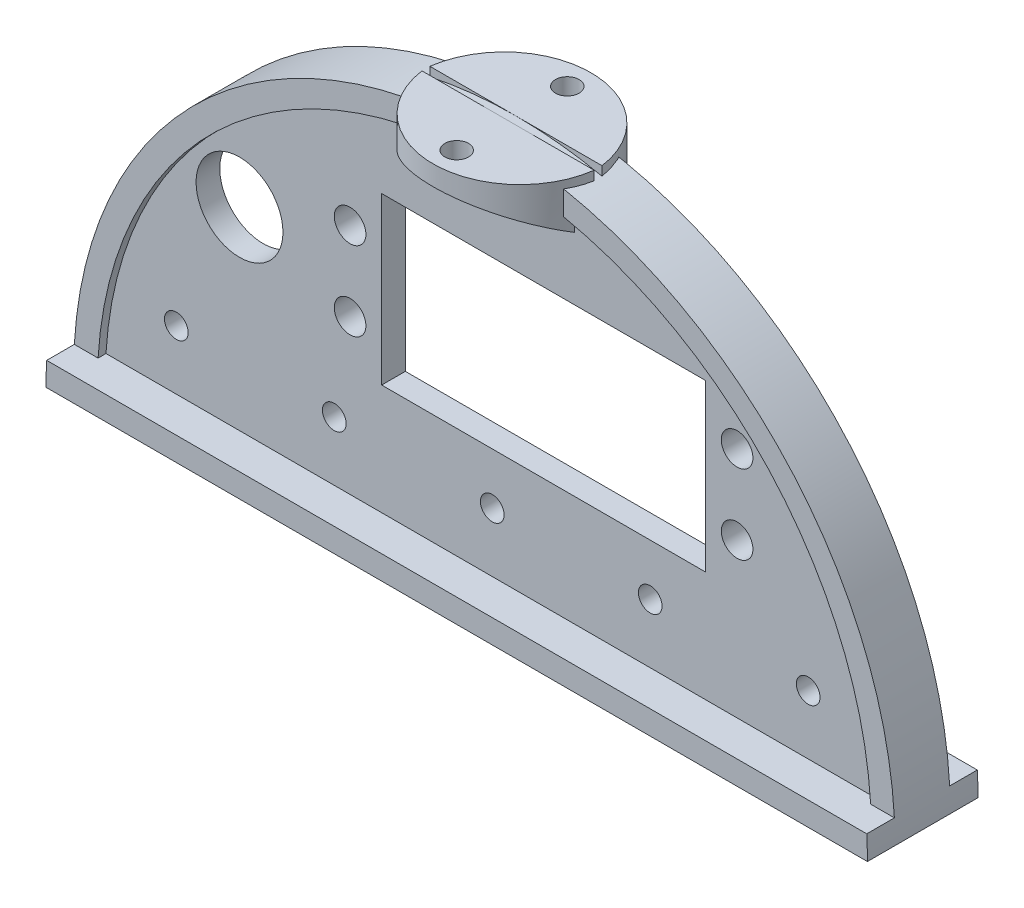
ISO-10303-21;
HEADER;
FILE_DESCRIPTION(('STEP AP214'),'2;1');
FILE_NAME('part.step','',(''),(''),'','','');
FILE_SCHEMA(('AUTOMOTIVE_DESIGN { 1 0 10303 214 1 1 1 1 }'));
ENDSEC;
DATA;
#1=APPLICATION_CONTEXT('core data for automotive mechanical design processes');
#2=APPLICATION_PROTOCOL_DEFINITION('international standard','automotive_design',2000,#1);
#3=PRODUCT_CONTEXT('',#1,'mechanical');
#4=PRODUCT('Part','Part','',(#3));
#5=PRODUCT_RELATED_PRODUCT_CATEGORY('part','',(#4));
#6=PRODUCT_DEFINITION_FORMATION('','',#4);
#7=PRODUCT_DEFINITION_CONTEXT('part definition',#1,'design');
#8=PRODUCT_DEFINITION('design','',#6,#7);
#9=PRODUCT_DEFINITION_SHAPE('','',#8);
#10=(LENGTH_UNIT() NAMED_UNIT(*) SI_UNIT(.MILLI.,.METRE.));
#11=(NAMED_UNIT(*) PLANE_ANGLE_UNIT() SI_UNIT($,.RADIAN.));
#12=(NAMED_UNIT(*) SI_UNIT($,.STERADIAN.) SOLID_ANGLE_UNIT());
#13=UNCERTAINTY_MEASURE_WITH_UNIT(LENGTH_MEASURE(1.E-05),#10,'distance_accuracy_value','');
#14=(GEOMETRIC_REPRESENTATION_CONTEXT(3) GLOBAL_UNCERTAINTY_ASSIGNED_CONTEXT((#13)) GLOBAL_UNIT_ASSIGNED_CONTEXT((#10,
#11,#12)) REPRESENTATION_CONTEXT('',''));
#15=CARTESIAN_POINT('',(0.,0.,0.));
#16=DIRECTION('',(0.,0.,1.));
#17=DIRECTION('',(1.,0.,0.));
#18=AXIS2_PLACEMENT_3D('',#15,#16,#17);
#19=CARTESIAN_POINT('',(52.,75.7749868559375,1.));
#20=DIRECTION('',(0.,-1.,0.));
#21=DIRECTION('',(0.,0.,-1.));
#22=AXIS2_PLACEMENT_3D('',#19,#20,#21);
#23=CYLINDRICAL_SURFACE('',#22,11.);
#24=DIRECTION('',(0.,-1.,0.));
#25=VECTOR('',#24,1.);
#26=CARTESIAN_POINT('',(62.8972473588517,75.7749868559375,-0.5));
#27=LINE('',#26,#25);
#28=CARTESIAN_POINT('',(62.8972473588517,52.,-0.5));
#29=VERTEX_POINT('',#28);
#30=CARTESIAN_POINT('',(62.8972473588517,45.,-0.5));
#31=VERTEX_POINT('',#30);
#32=EDGE_CURVE('E61',#29,#31,#27,.T.);
#33=ORIENTED_EDGE('',*,*,#32,.T.);
#34=CARTESIAN_POINT('',(52.,44.2894736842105,1.));
#35=DIRECTION('',(0.,0.903737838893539,0.428086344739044));
#36=DIRECTION('',(0.,-0.428086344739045,0.903737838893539));
#37=AXIS2_PLACEMENT_3D('',#34,#35,#36);
#38=ELLIPSE('',#37,12.1716713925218,11.);
#39=CARTESIAN_POINT('',(41.1027526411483,45.,-0.5));
#40=VERTEX_POINT('',#39);
#41=EDGE_CURVE('E73',#31,#40,#38,.T.);
#42=ORIENTED_EDGE('',*,*,#41,.T.);
#43=DIRECTION('',(0.,-1.,0.));
#44=VECTOR('',#43,1.);
#45=CARTESIAN_POINT('',(41.1027526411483,75.7749868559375,-0.5));
#46=LINE('',#45,#44);
#47=CARTESIAN_POINT('',(41.1027526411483,52.,-0.5));
#48=VERTEX_POINT('',#47);
#49=EDGE_CURVE('E69',#48,#40,#46,.T.);
#50=ORIENTED_EDGE('',*,*,#49,.F.);
#51=CARTESIAN_POINT('',(52.,52.,1.));
#52=DIRECTION('',(0.,1.,0.));
#53=DIRECTION('',(0.,0.,1.));
#54=AXIS2_PLACEMENT_3D('',#51,#52,#53);
#55=CIRCLE('',#54,11.);
#56=EDGE_CURVE('E12',#29,#48,#55,.T.);
#57=ORIENTED_EDGE('',*,*,#56,.F.);
#58=EDGE_LOOP('',(#33,#42,#50,#57));
#59=FACE_BOUND('',#58,.T.);
#60=ADVANCED_FACE('F44',(#59),#23,.T.);
#61=CARTESIAN_POINT('',(41.1027526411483,75.7749868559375,-0.5));
#62=DIRECTION('',(0.,0.,-1.));
#63=DIRECTION('',(-1.,0.,0.));
#64=AXIS2_PLACEMENT_3D('',#61,#62,#63);
#65=PLANE('',#64);
#66=DIRECTION('',(1.,0.,0.));
#67=VECTOR('',#66,1.);
#68=CARTESIAN_POINT('',(41.1027526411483,52.,-0.5));
#69=LINE('',#68,#67);
#70=EDGE_CURVE('E53',#48,#29,#69,.T.);
#71=ORIENTED_EDGE('',*,*,#70,.F.);
#72=ORIENTED_EDGE('',*,*,#49,.T.);
#73=DIRECTION('',(1.,0.,0.));
#74=VECTOR('',#73,1.);
#75=CARTESIAN_POINT('',(41.1027526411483,45.,-0.5));
#76=LINE('',#75,#74);
#77=EDGE_CURVE('E77',#40,#31,#76,.T.);
#78=ORIENTED_EDGE('',*,*,#77,.T.);
#79=ORIENTED_EDGE('',*,*,#32,.F.);
#80=EDGE_LOOP('',(#71,#72,#78,#79));
#81=FACE_BOUND('',#80,.T.);
#82=ADVANCED_FACE('F80',(#81),#65,.F.);
#83=CARTESIAN_POINT('',(0.,52.,0.));
#84=DIRECTION('',(0.,1.,0.));
#85=DIRECTION('',(0.,0.,1.));
#86=AXIS2_PLACEMENT_3D('',#83,#84,#85);
#87=PLANE('',#86);
#88=CARTESIAN_POINT('',(52.,52.,-7.));
#89=DIRECTION('',(0.,1.,0.));
#90=DIRECTION('',(0.,0.,1.));
#91=AXIS2_PLACEMENT_3D('',#88,#89,#90);
#92=CIRCLE('',#91,1.5);
#93=CARTESIAN_POINT('',(52.,52.,-5.5));
#94=VERTEX_POINT('',#93);
#95=EDGE_CURVE('E85',#94,#94,#92,.T.);
#96=ORIENTED_EDGE('',*,*,#95,.F.);
#97=EDGE_LOOP('',(#96));
#98=FACE_BOUND('',#97,.T.);
#99=ORIENTED_EDGE('',*,*,#70,.T.);
#100=ORIENTED_EDGE('',*,*,#56,.T.);
#101=EDGE_LOOP('',(#99,#100));
#102=FACE_BOUND('',#101,.T.);
#103=ADVANCED_FACE('F46',(#98,#102),#87,.T.);
#104=CARTESIAN_POINT('',(40.5,49.5,-10.));
#105=DIRECTION('',(0.,0.903737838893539,0.428086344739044));
#106=DIRECTION('',(0.,-0.428086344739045,0.903737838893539));
#107=AXIS2_PLACEMENT_3D('',#104,#105,#106);
#108=PLANE('',#107);
#109=CARTESIAN_POINT('',(52.,48.0789473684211,-7.));
#110=DIRECTION('',(0.,0.903737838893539,0.428086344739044));
#111=DIRECTION('',(0.,0.428086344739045,-0.903737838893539));
#112=AXIS2_PLACEMENT_3D('',#109,#110,#111);
#113=ELLIPSE('',#112,1.65977337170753,1.5);
#114=CARTESIAN_POINT('',(52.,48.7894736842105,-8.5));
#115=VERTEX_POINT('',#114);
#116=EDGE_CURVE('E48',#115,#115,#113,.T.);
#117=ORIENTED_EDGE('',*,*,#116,.T.);
#118=EDGE_LOOP('',(#117));
#119=FACE_BOUND('',#118,.T.);
#120=ORIENTED_EDGE('',*,*,#77,.F.);
#121=ORIENTED_EDGE('',*,*,#41,.F.);
#122=EDGE_LOOP('',(#120,#121));
#123=FACE_BOUND('',#122,.T.);
#124=ADVANCED_FACE('F78',(#119,#123),#108,.F.);
#125=CARTESIAN_POINT('',(52.,29.,-7.));
#126=DIRECTION('',(0.,1.,0.));
#127=DIRECTION('',(0.,0.,1.));
#128=AXIS2_PLACEMENT_3D('',#125,#126,#127);
#129=CYLINDRICAL_SURFACE('',#128,1.5);
#130=ORIENTED_EDGE('',*,*,#95,.T.);
#131=EDGE_LOOP('',(#130));
#132=FACE_BOUND('',#131,.T.);
#133=ORIENTED_EDGE('',*,*,#116,.F.);
#134=EDGE_LOOP('',(#133));
#135=FACE_BOUND('',#134,.T.);
#136=ADVANCED_FACE('F93',(#132,#135),#129,.F.);
#137=CLOSED_SHELL('',(#60,#82,#103,#124,#136));
#138=MANIFOLD_SOLID_BREP('B2',#137);
#139=CARTESIAN_POINT('',(52.,0.,7.));
#140=DIRECTION('',(0.,0.,-1.));
#141=DIRECTION('',(-1.,0.,0.));
#142=AXIS2_PLACEMENT_3D('',#139,#140,#141);
#143=CYLINDRICAL_SURFACE('',#142,52.);
#144=CARTESIAN_POINT('',(59.5498344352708,51.4490038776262,7.));
#145=CARTESIAN_POINT('',(59.7742903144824,51.4160678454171,6.78821176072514));
#146=CARTESIAN_POINT('',(59.9897803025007,51.3829435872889,6.56695518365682));
#147=CARTESIAN_POINT('',(60.4014594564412,51.3172378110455,6.10707831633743));
#148=CARTESIAN_POINT('',(60.597648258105,51.284656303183,5.86845769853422));
#149=CARTESIAN_POINT('',(60.9693924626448,51.220948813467,5.37537408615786));
#150=CARTESIAN_POINT('',(61.1449428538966,51.1898231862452,5.12090726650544));
#151=CARTESIAN_POINT('',(61.4741155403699,51.1299240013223,4.59790941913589));
#152=CARTESIAN_POINT('',(61.627738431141,51.1011503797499,4.32937877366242));
#153=CARTESIAN_POINT('',(61.912070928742,51.0467612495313,3.77981754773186));
#154=CARTESIAN_POINT('',(62.0427590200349,51.0211487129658,3.49877553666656));
#155=CARTESIAN_POINT('',(62.2800532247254,50.9738673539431,2.92638336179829));
#156=CARTESIAN_POINT('',(62.3866597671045,50.9521984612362,2.63503338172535));
#157=CARTESIAN_POINT('',(62.5748952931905,50.9134641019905,2.0442786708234));
#158=CARTESIAN_POINT('',(62.6565402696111,50.8963956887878,1.74487923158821));
#159=CARTESIAN_POINT('',(62.7942818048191,50.8673612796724,1.14001916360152));
#160=CARTESIAN_POINT('',(62.8503789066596,50.8553951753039,0.834558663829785));
#161=CARTESIAN_POINT('',(62.9359410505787,50.8370640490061,0.22424544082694));
#162=CARTESIAN_POINT('',(62.9657771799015,50.8306210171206,-0.0805529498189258));
#163=CARTESIAN_POINT('',(62.999934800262,50.8232401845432,-0.691645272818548));
#164=CARTESIAN_POINT('',(63.0042562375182,50.8223023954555,-0.997939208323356));
#165=CARTESIAN_POINT('',(62.9873428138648,50.8259615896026,-1.60998447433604));
#166=CARTESIAN_POINT('',(62.966091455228,50.8305621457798,-1.91573532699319));
#167=CARTESIAN_POINT('',(62.8981814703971,50.8451653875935,-2.52425840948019));
#168=CARTESIAN_POINT('',(62.8515239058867,50.8551678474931,-2.82703076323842));
#169=CARTESIAN_POINT('',(62.7338377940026,50.8801365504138,-3.42410691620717));
#170=CARTESIAN_POINT('',(62.663084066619,50.8950467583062,-3.71846731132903));
#171=CARTESIAN_POINT('',(62.4976502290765,50.9294263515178,-4.30011425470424));
#172=CARTESIAN_POINT('',(62.4029701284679,50.9488957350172,-4.58740080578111));
#173=CARTESIAN_POINT('',(62.1905963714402,50.9917979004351,-5.15243246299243));
#174=CARTESIAN_POINT('',(62.0729435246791,51.015223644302,-5.43019347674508));
#175=CARTESIAN_POINT('',(61.8154161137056,51.0653971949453,-5.9747600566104));
#176=CARTESIAN_POINT('',(61.6755543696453,51.0921430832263,-6.24157183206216));
#177=CARTESIAN_POINT('',(61.4763593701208,51.1292584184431,-6.58642339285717));
#178=CARTESIAN_POINT('',(61.426495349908,51.1384773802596,-6.67015750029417));
#179=CARTESIAN_POINT('',(61.3246278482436,51.1571499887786,-6.83616158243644));
#180=CARTESIAN_POINT('',(61.2726267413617,51.1666033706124,-6.91843304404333));
#181=CARTESIAN_POINT('',(61.2195444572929,51.1761663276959,-7.));
#182=B_SPLINE_CURVE_WITH_KNOTS('',3,(#144,#145,#146,#147,#148,#149,#150,#151,#152,#153,#154,
#155,#156,#157,#158,#159,#160,#161,#162,#163,#164,#165,#166,#167,#168,#169,#170,#171,#172,#173,
#174,#175,#176,#177,#178,#179,#180,#181),.UNSPECIFIED.,.F.,.F.,(4,2,2,2,2,2,2,2,2,2,2,2,2,2,2,2,
2,2,4),(0.,0.930786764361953,1.8615910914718,2.79262098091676,3.72362557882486,4.6554989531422,
5.58735572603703,6.5186142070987,7.44985289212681,8.36771085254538,9.28557074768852,
10.2040230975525,11.1224370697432,12.0307089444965,12.9389804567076,13.8456529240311,
14.7518039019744,15.0454549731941,15.3387881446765),.UNSPECIFIED.);
#183=CARTESIAN_POINT('',(62.0374299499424,51.0220540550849,3.5));
#184=VERTEX_POINT('',#183);
#185=CARTESIAN_POINT('',(62.8972473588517,50.8453537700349,0.5));
#186=VERTEX_POINT('',#185);
#187=EDGE_CURVE('E324',#184,#186,#182,.T.);
#188=ORIENTED_EDGE('',*,*,#187,.F.);
#189=CARTESIAN_POINT('',(52.,0.,3.5));
#190=DIRECTION('',(0.,0.,1.));
#191=DIRECTION('',(1.,0.,0.));
#192=AXIS2_PLACEMENT_3D('',#189,#190,#191);
#193=CIRCLE('',#192,52.);
#194=CARTESIAN_POINT('',(103.91338940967,3.,3.5));
#195=VERTEX_POINT('',#194);
#196=EDGE_CURVE('E466',#195,#184,#193,.T.);
#197=ORIENTED_EDGE('',*,*,#196,.F.);
#198=DIRECTION('',(0.,0.,1.));
#199=VECTOR('',#198,1.);
#200=CARTESIAN_POINT('',(103.91338940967,3.,3.5));
#201=LINE('',#200,#199);
#202=CARTESIAN_POINT('',(103.91338940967,3.,7.));
#203=VERTEX_POINT('',#202);
#204=EDGE_CURVE('E476',#195,#203,#201,.T.);
#205=ORIENTED_EDGE('',*,*,#204,.T.);
#206=CARTESIAN_POINT('',(52.,0.,7.));
#207=DIRECTION('',(0.,0.,1.));
#208=DIRECTION('',(-1.,0.,0.));
#209=AXIS2_PLACEMENT_3D('',#206,#207,#208);
#210=CIRCLE('',#209,52.);
#211=CARTESIAN_POINT('',(104.,0.,7.));
#212=VERTEX_POINT('',#211);
#213=EDGE_CURVE('E493',#212,#203,#210,.T.);
#214=ORIENTED_EDGE('',*,*,#213,.F.);
#215=DIRECTION('',(0.,0.,-1.));
#216=VECTOR('',#215,1.);
#217=CARTESIAN_POINT('',(104.,0.,7.));
#218=LINE('',#217,#216);
#219=CARTESIAN_POINT('',(104.,0.,-7.));
#220=VERTEX_POINT('',#219);
#221=EDGE_CURVE('E499',#212,#220,#218,.T.);
#222=ORIENTED_EDGE('',*,*,#221,.T.);
#223=CARTESIAN_POINT('',(52.,0.,-7.));
#224=DIRECTION('',(0.,0.,1.));
#225=DIRECTION('',(-1.,0.,0.));
#226=AXIS2_PLACEMENT_3D('',#223,#224,#225);
#227=CIRCLE('',#226,52.);
#228=CARTESIAN_POINT('',(103.91338940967,3.,-7.));
#229=VERTEX_POINT('',#228);
#230=EDGE_CURVE('E500',#220,#229,#227,.T.);
#231=ORIENTED_EDGE('',*,*,#230,.T.);
#232=DIRECTION('',(0.,0.,-1.));
#233=VECTOR('',#232,1.);
#234=CARTESIAN_POINT('',(103.91338940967,3.,-3.5));
#235=LINE('',#234,#233);
#236=CARTESIAN_POINT('',(103.91338940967,3.,-3.5));
#237=VERTEX_POINT('',#236);
#238=EDGE_CURVE('E402',#237,#229,#235,.T.);
#239=ORIENTED_EDGE('',*,*,#238,.F.);
#240=CARTESIAN_POINT('',(52.,0.,-3.5));
#241=DIRECTION('',(0.,0.,1.));
#242=DIRECTION('',(1.,0.,0.));
#243=AXIS2_PLACEMENT_3D('',#240,#241,#242);
#244=CIRCLE('',#243,52.);
#245=CARTESIAN_POINT('',(0.0866105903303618,3.,-3.5));
#246=VERTEX_POINT('',#245);
#247=EDGE_CURVE('E395',#237,#246,#244,.T.);
#248=ORIENTED_EDGE('',*,*,#247,.T.);
#249=DIRECTION('',(0.,0.,-1.));
#250=VECTOR('',#249,1.);
#251=CARTESIAN_POINT('',(0.0866105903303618,3.,-3.5));
#252=LINE('',#251,#250);
#253=CARTESIAN_POINT('',(0.0866105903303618,3.,-7.));
#254=VERTEX_POINT('',#253);
#255=EDGE_CURVE('E405',#246,#254,#252,.T.);
#256=ORIENTED_EDGE('',*,*,#255,.T.);
#257=CARTESIAN_POINT('',(0.,0.,-7.));
#258=VERTEX_POINT('',#257);
#259=EDGE_CURVE('E492',#254,#258,#227,.T.);
#260=ORIENTED_EDGE('',*,*,#259,.T.);
#261=DIRECTION('',(0.,0.,-1.));
#262=VECTOR('',#261,1.);
#263=CARTESIAN_POINT('',(0.,0.,7.));
#264=LINE('',#263,#262);
#265=CARTESIAN_POINT('',(0.,0.,7.));
#266=VERTEX_POINT('',#265);
#267=EDGE_CURVE('E507',#266,#258,#264,.T.);
#268=ORIENTED_EDGE('',*,*,#267,.F.);
#269=CARTESIAN_POINT('',(0.0866105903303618,3.,7.));
#270=VERTEX_POINT('',#269);
#271=EDGE_CURVE('E497',#270,#266,#210,.T.);
#272=ORIENTED_EDGE('',*,*,#271,.F.);
#273=DIRECTION('',(0.,0.,1.));
#274=VECTOR('',#273,1.);
#275=CARTESIAN_POINT('',(0.0866105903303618,3.,3.5));
#276=LINE('',#275,#274);
#277=CARTESIAN_POINT('',(0.0866105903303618,3.,3.5));
#278=VERTEX_POINT('',#277);
#279=EDGE_CURVE('E474',#278,#270,#276,.T.);
#280=ORIENTED_EDGE('',*,*,#279,.F.);
#281=CARTESIAN_POINT('',(41.9625700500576,51.0220540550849,3.5));
#282=VERTEX_POINT('',#281);
#283=EDGE_CURVE('E470',#282,#278,#193,.T.);
#284=ORIENTED_EDGE('',*,*,#283,.F.);
#285=CARTESIAN_POINT('',(42.7804555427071,51.1761663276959,-7.));
#286=CARTESIAN_POINT('',(42.6141512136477,51.1461973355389,-6.74451241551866));
#287=CARTESIAN_POINT('',(42.4584541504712,51.1173190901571,-6.48198480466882));
#288=CARTESIAN_POINT('',(42.1692682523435,51.0624972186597,-5.94465706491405));
#289=CARTESIAN_POINT('',(42.0357808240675,51.0365537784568,-5.66985616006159));
#290=CARTESIAN_POINT('',(41.7920397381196,50.9883607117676,-5.10984638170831));
#291=CARTESIAN_POINT('',(41.6817840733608,50.9661107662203,-4.82463840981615));
#292=CARTESIAN_POINT('',(41.4853253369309,50.9259432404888,-4.24576961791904));
#293=CARTESIAN_POINT('',(41.3991211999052,50.9080254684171,-3.95210917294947));
#294=CARTESIAN_POINT('',(41.2513542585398,50.8770314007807,-3.35805108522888));
#295=CARTESIAN_POINT('',(41.1898189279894,50.8639605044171,-3.05764632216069));
#296=CARTESIAN_POINT('',(41.0920233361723,50.8430777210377,-2.45257084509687));
#297=CARTESIAN_POINT('',(41.0557628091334,50.8352657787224,-2.14790017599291));
#298=CARTESIAN_POINT('',(41.0088282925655,50.8251386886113,-1.53668775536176));
#299=CARTESIAN_POINT('',(40.9981388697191,50.8228202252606,-1.23014724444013));
#300=CARTESIAN_POINT('',(41.0023903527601,50.8237403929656,-0.61725685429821));
#301=CARTESIAN_POINT('',(41.0173308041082,50.8269789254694,-0.310906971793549));
#302=CARTESIAN_POINT('',(41.0723795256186,50.8388423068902,0.295653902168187));
#303=CARTESIAN_POINT('',(41.1121794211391,50.8474011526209,0.595894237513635));
#304=CARTESIAN_POINT('',(41.2163488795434,50.869595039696,1.19189065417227));
#305=CARTESIAN_POINT('',(41.2807185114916,50.8832300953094,1.48764672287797));
#306=CARTESIAN_POINT('',(41.433579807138,50.9151928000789,2.07283023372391));
#307=CARTESIAN_POINT('',(41.5220893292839,50.9335239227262,2.36225281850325));
#308=CARTESIAN_POINT('',(41.722531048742,50.9743472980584,2.93255470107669));
#309=CARTESIAN_POINT('',(41.8344626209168,50.9968394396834,3.213434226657));
#310=CARTESIAN_POINT('',(42.0817928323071,51.0455204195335,3.7667222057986));
#311=CARTESIAN_POINT('',(42.2173513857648,51.0717342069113,4.0390569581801));
#312=CARTESIAN_POINT('',(42.5104098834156,51.1269977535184,4.57135369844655));
#313=CARTESIAN_POINT('',(42.6679099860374,51.1560475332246,4.83131559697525));
#314=CARTESIAN_POINT('',(43.003455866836,51.2161223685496,5.33672329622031));
#315=CARTESIAN_POINT('',(43.1814664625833,51.2471440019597,5.5821928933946));
#316=CARTESIAN_POINT('',(43.5569822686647,51.3103464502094,6.05741296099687));
#317=CARTESIAN_POINT('',(43.754476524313,51.3425266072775,6.28717214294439));
#318=CARTESIAN_POINT('',(44.0399957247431,51.3872039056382,6.59287365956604));
#319=CARTESIAN_POINT('',(44.1202843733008,51.3995806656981,6.67616241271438));
#320=CARTESIAN_POINT('',(44.2833525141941,51.4243146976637,6.84006965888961));
#321=CARTESIAN_POINT('',(44.3661289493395,51.4366719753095,6.92069119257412));
#322=CARTESIAN_POINT('',(44.4501655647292,51.4490038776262,7.));
#323=B_SPLINE_CURVE_WITH_KNOTS('',3,(#285,#286,#287,#288,#289,#290,#291,#292,#293,#294,#295,
#296,#297,#298,#299,#300,#301,#302,#303,#304,#305,#306,#307,#308,#309,#310,#311,#312,#313,#314,
#315,#316,#317,#318,#319,#320,#321,#322),.UNSPECIFIED.,.F.,.F.,(4,2,2,2,2,2,2,2,2,2,2,2,2,2,2,2,
2,2,4),(0.,0.918693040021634,1.83744424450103,2.75611604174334,3.67474714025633,
4.59439850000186,5.51404018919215,6.43312669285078,7.35219689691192,8.26008671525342,
9.16797908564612,10.0765449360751,10.9850865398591,11.9000348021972,12.8149896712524,
13.7283978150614,14.6412952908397,14.9902898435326,15.3388717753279),.UNSPECIFIED.);
#324=CARTESIAN_POINT('',(41.1027526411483,50.8453537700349,0.5));
#325=VERTEX_POINT('',#324);
#326=EDGE_CURVE('E338',#325,#282,#323,.T.);
#327=ORIENTED_EDGE('',*,*,#326,.F.);
#328=CARTESIAN_POINT('',(52.,0.,0.5));
#329=DIRECTION('',(0.,0.,1.));
#330=DIRECTION('',(1.,0.,0.));
#331=AXIS2_PLACEMENT_3D('',#328,#329,#330);
#332=CIRCLE('',#331,52.);
#333=CARTESIAN_POINT('',(52.,52.,0.5));
#334=VERTEX_POINT('',#333);
#335=EDGE_CURVE('E145',#334,#325,#332,.T.);
#336=ORIENTED_EDGE('',*,*,#335,.F.);
#337=EDGE_CURVE('E42',#186,#334,#332,.T.);
#338=ORIENTED_EDGE('',*,*,#337,.F.);
#339=EDGE_LOOP('',(#188,#197,#205,#214,#222,#231,#239,#248,#256,#260,#268,#272,#280,#284,#327,
#336,#338));
#340=FACE_BOUND('',#339,.T.);
#341=ADVANCED_FACE('F136',(#340),#143,.T.);
#342=CARTESIAN_POINT('',(52.,0.,3.5));
#343=DIRECTION('',(0.,0.,1.));
#344=DIRECTION('',(1.,0.,0.));
#345=AXIS2_PLACEMENT_3D('',#342,#343,#344);
#346=PLANE('',#345);
#347=CARTESIAN_POINT('',(52.,0.,3.5));
#348=DIRECTION('',(0.,0.,1.));
#349=DIRECTION('',(1.,0.,0.));
#350=AXIS2_PLACEMENT_3D('',#347,#348,#349);
#351=CIRCLE('',#350,49.);
#352=CARTESIAN_POINT('',(41.9625700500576,47.9609215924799,3.5));
#353=VERTEX_POINT('',#352);
#354=CARTESIAN_POINT('',(3.09192295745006,3.,3.5));
#355=VERTEX_POINT('',#354);
#356=EDGE_CURVE('E408',#353,#355,#351,.T.);
#357=ORIENTED_EDGE('',*,*,#356,.F.);
#358=DIRECTION('',(0.,-1.,0.));
#359=VECTOR('',#358,1.);
#360=CARTESIAN_POINT('',(41.9625700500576,75.7749868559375,3.5));
#361=LINE('',#360,#359);
#362=EDGE_CURVE('E336',#353,#282,#361,.F.);
#363=ORIENTED_EDGE('',*,*,#362,.T.);
#364=ORIENTED_EDGE('',*,*,#283,.T.);
#365=DIRECTION('',(1.,0.,0.));
#366=VECTOR('',#365,1.);
#367=CARTESIAN_POINT('',(0.0866105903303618,3.,3.5));
#368=LINE('',#367,#366);
#369=EDGE_CURVE('E471',#278,#355,#368,.T.);
#370=ORIENTED_EDGE('',*,*,#369,.T.);
#371=EDGE_LOOP('',(#357,#363,#364,#370));
#372=FACE_BOUND('',#371,.T.);
#373=ADVANCED_FACE('F551',(#372),#346,.T.);
#374=ORIENTED_EDGE('',*,*,#196,.T.);
#375=DIRECTION('',(0.,-1.,0.));
#376=VECTOR('',#375,1.);
#377=CARTESIAN_POINT('',(62.0374299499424,75.7749868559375,3.5));
#378=LINE('',#377,#376);
#379=CARTESIAN_POINT('',(62.0374299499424,47.9609215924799,3.5));
#380=VERTEX_POINT('',#379);
#381=EDGE_CURVE('E307',#184,#380,#378,.T.);
#382=ORIENTED_EDGE('',*,*,#381,.T.);
#383=CARTESIAN_POINT('',(100.90807704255,3.,3.5));
#384=VERTEX_POINT('',#383);
#385=EDGE_CURVE('E418',#384,#380,#351,.T.);
#386=ORIENTED_EDGE('',*,*,#385,.F.);
#387=EDGE_CURVE('E469',#384,#195,#368,.T.);
#388=ORIENTED_EDGE('',*,*,#387,.T.);
#389=EDGE_LOOP('',(#374,#382,#386,#388));
#390=FACE_BOUND('',#389,.T.);
#391=ADVANCED_FACE('F542',(#390),#346,.T.);
#392=CARTESIAN_POINT('',(52.,0.,2.5));
#393=DIRECTION('',(0.,0.,1.));
#394=DIRECTION('',(1.,0.,0.));
#395=AXIS2_PLACEMENT_3D('',#392,#393,#394);
#396=CYLINDRICAL_SURFACE('',#395,49.);
#397=CARTESIAN_POINT('',(62.4283268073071,47.8774477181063,2.5));
#398=CARTESIAN_POINT('',(62.3712750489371,47.8899075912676,2.66995327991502));
#399=CARTESIAN_POINT('',(62.3101744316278,47.9030936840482,2.83826325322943));
#400=CARTESIAN_POINT('',(62.1798754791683,47.9309183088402,3.17159658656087));
#401=CARTESIAN_POINT('',(62.1106771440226,47.9455568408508,3.33661994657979));
#402=CARTESIAN_POINT('',(62.0374299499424,47.9609215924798,3.5));
#403=B_SPLINE_CURVE_WITH_KNOTS('',3,(#397,#398,#399,#400,#401,#402),.UNSPECIFIED.,.F.,.F.,(4,2,
4),(0.,0.538626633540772,1.07725326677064),.UNSPECIFIED.);
#404=CARTESIAN_POINT('',(62.4283268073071,47.8774477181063,2.5));
#405=VERTEX_POINT('',#404);
#406=EDGE_CURVE('E286',#405,#380,#403,.T.);
#407=ORIENTED_EDGE('',*,*,#406,.F.);
#408=CARTESIAN_POINT('',(52.,0.,2.5));
#409=DIRECTION('',(0.,0.,1.));
#410=DIRECTION('',(1.,0.,0.));
#411=AXIS2_PLACEMENT_3D('',#408,#409,#410);
#412=CIRCLE('',#411,49.);
#413=CARTESIAN_POINT('',(100.90807704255,3.,2.5));
#414=VERTEX_POINT('',#413);
#415=EDGE_CURVE('E410',#414,#405,#412,.T.);
#416=ORIENTED_EDGE('',*,*,#415,.F.);
#417=DIRECTION('',(0.,0.,1.));
#418=VECTOR('',#417,1.);
#419=CARTESIAN_POINT('',(100.90807704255,3.,2.5));
#420=LINE('',#419,#418);
#421=EDGE_CURVE('E421',#414,#384,#420,.T.);
#422=ORIENTED_EDGE('',*,*,#421,.T.);
#423=ORIENTED_EDGE('',*,*,#385,.T.);
#424=EDGE_LOOP('',(#407,#416,#422,#423));
#425=FACE_BOUND('',#424,.T.);
#426=ADVANCED_FACE('F309',(#425),#396,.F.);
#427=CARTESIAN_POINT('',(41.9625700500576,47.9609215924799,3.5));
#428=CARTESIAN_POINT('',(41.8893228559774,47.9455568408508,3.33661994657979));
#429=CARTESIAN_POINT('',(41.8201245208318,47.9309183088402,3.17159658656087));
#430=CARTESIAN_POINT('',(41.6898255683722,47.9030936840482,2.83826325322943));
#431=CARTESIAN_POINT('',(41.6287249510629,47.8899075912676,2.66995327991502));
#432=CARTESIAN_POINT('',(41.5716731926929,47.8774477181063,2.5));
#433=B_SPLINE_CURVE_WITH_KNOTS('',3,(#427,#428,#429,#430,#431,#432),.UNSPECIFIED.,.F.,.F.,(4,2,
4),(0.,0.538626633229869,1.07725326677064),.UNSPECIFIED.);
#434=CARTESIAN_POINT('',(41.5716731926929,47.8774477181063,2.5));
#435=VERTEX_POINT('',#434);
#436=EDGE_CURVE('E330',#353,#435,#433,.T.);
#437=ORIENTED_EDGE('',*,*,#436,.F.);
#438=ORIENTED_EDGE('',*,*,#356,.T.);
#439=DIRECTION('',(0.,0.,1.));
#440=VECTOR('',#439,1.);
#441=CARTESIAN_POINT('',(3.09192295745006,3.,2.5));
#442=LINE('',#441,#440);
#443=CARTESIAN_POINT('',(3.09192295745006,3.,2.5));
#444=VERTEX_POINT('',#443);
#445=EDGE_CURVE('E417',#444,#355,#442,.T.);
#446=ORIENTED_EDGE('',*,*,#445,.F.);
#447=EDGE_CURVE('E414',#435,#444,#412,.T.);
#448=ORIENTED_EDGE('',*,*,#447,.F.);
#449=EDGE_LOOP('',(#437,#438,#446,#448));
#450=FACE_BOUND('',#449,.T.);
#451=ADVANCED_FACE('F528',(#450),#396,.F.);
#452=CARTESIAN_POINT('',(52.,0.,2.5));
#453=DIRECTION('',(0.,0.,1.));
#454=DIRECTION('',(1.,0.,0.));
#455=AXIS2_PLACEMENT_3D('',#452,#453,#454);
#456=PLANE('',#455);
#457=CARTESIAN_POINT('',(92.,10.5,2.5));
#458=DIRECTION('',(0.,0.,1.));
#459=DIRECTION('',(1.,0.,0.));
#460=AXIS2_PLACEMENT_3D('',#457,#458,#459);
#461=CIRCLE('',#460,1.5);
#462=CARTESIAN_POINT('',(93.5,10.5,2.5));
#463=VERTEX_POINT('',#462);
#464=EDGE_CURVE('E423',#463,#463,#461,.T.);
#465=ORIENTED_EDGE('',*,*,#464,.F.);
#466=EDGE_LOOP('',(#465));
#467=FACE_BOUND('',#466,.T.);
#468=CARTESIAN_POINT('',(72.,10.5,2.5));
#469=DIRECTION('',(0.,0.,1.));
#470=DIRECTION('',(1.,0.,0.));
#471=AXIS2_PLACEMENT_3D('',#468,#469,#470);
#472=CIRCLE('',#471,1.5);
#473=CARTESIAN_POINT('',(73.5,10.5,2.5));
#474=VERTEX_POINT('',#473);
#475=EDGE_CURVE('E426',#474,#474,#472,.T.);
#476=ORIENTED_EDGE('',*,*,#475,.F.);
#477=EDGE_LOOP('',(#476));
#478=FACE_BOUND('',#477,.T.);
#479=CARTESIAN_POINT('',(12.,10.5,2.5));
#480=DIRECTION('',(0.,0.,1.));
#481=DIRECTION('',(1.,0.,0.));
#482=AXIS2_PLACEMENT_3D('',#479,#480,#481);
#483=CIRCLE('',#482,1.5);
#484=CARTESIAN_POINT('',(13.5,10.5,2.5));
#485=VERTEX_POINT('',#484);
#486=EDGE_CURVE('E429',#485,#485,#483,.T.);
#487=ORIENTED_EDGE('',*,*,#486,.F.);
#488=EDGE_LOOP('',(#487));
#489=FACE_BOUND('',#488,.T.);
#490=CARTESIAN_POINT('',(32.,10.5,2.5));
#491=DIRECTION('',(0.,0.,1.));
#492=DIRECTION('',(1.,0.,0.));
#493=AXIS2_PLACEMENT_3D('',#490,#491,#492);
#494=CIRCLE('',#493,1.5);
#495=CARTESIAN_POINT('',(33.5,10.5,2.5));
#496=VERTEX_POINT('',#495);
#497=EDGE_CURVE('E432',#496,#496,#494,.T.);
#498=ORIENTED_EDGE('',*,*,#497,.F.);
#499=EDGE_LOOP('',(#498));
#500=FACE_BOUND('',#499,.T.);
#501=CARTESIAN_POINT('',(52.,10.5,2.5));
#502=DIRECTION('',(0.,0.,1.));
#503=DIRECTION('',(1.,0.,0.));
#504=AXIS2_PLACEMENT_3D('',#501,#502,#503);
#505=CIRCLE('',#504,1.5);
#506=CARTESIAN_POINT('',(53.5,10.5,2.5));
#507=VERTEX_POINT('',#506);
#508=EDGE_CURVE('E435',#507,#507,#505,.T.);
#509=ORIENTED_EDGE('',*,*,#508,.F.);
#510=EDGE_LOOP('',(#509));
#511=FACE_BOUND('',#510,.T.);
#512=CARTESIAN_POINT('',(20.,27.5,2.5));
#513=DIRECTION('',(0.,0.,1.));
#514=DIRECTION('',(1.,0.,0.));
#515=AXIS2_PLACEMENT_3D('',#512,#513,#514);
#516=CIRCLE('',#515,5.5);
#517=CARTESIAN_POINT('',(25.5,27.5,2.5));
#518=VERTEX_POINT('',#517);
#519=EDGE_CURVE('E438',#518,#518,#516,.T.);
#520=ORIENTED_EDGE('',*,*,#519,.F.);
#521=EDGE_LOOP('',(#520));
#522=FACE_BOUND('',#521,.T.);
#523=CARTESIAN_POINT('',(34.,32.5,2.5));
#524=DIRECTION('',(0.,0.,1.));
#525=DIRECTION('',(1.,0.,0.));
#526=AXIS2_PLACEMENT_3D('',#523,#524,#525);
#527=CIRCLE('',#526,2.);
#528=CARTESIAN_POINT('',(36.,32.5,2.5));
#529=VERTEX_POINT('',#528);
#530=EDGE_CURVE('E441',#529,#529,#527,.T.);
#531=ORIENTED_EDGE('',*,*,#530,.F.);
#532=EDGE_LOOP('',(#531));
#533=FACE_BOUND('',#532,.T.);
#534=CARTESIAN_POINT('',(34.,22.5,2.5));
#535=DIRECTION('',(0.,0.,1.));
#536=DIRECTION('',(1.,0.,0.));
#537=AXIS2_PLACEMENT_3D('',#534,#535,#536);
#538=CIRCLE('',#537,2.);
#539=CARTESIAN_POINT('',(36.,22.5,2.5));
#540=VERTEX_POINT('',#539);
#541=EDGE_CURVE('E444',#540,#540,#538,.T.);
#542=ORIENTED_EDGE('',*,*,#541,.F.);
#543=EDGE_LOOP('',(#542));
#544=FACE_BOUND('',#543,.T.);
#545=CARTESIAN_POINT('',(83.,22.5,2.5));
#546=DIRECTION('',(0.,0.,1.));
#547=DIRECTION('',(1.,0.,0.));
#548=AXIS2_PLACEMENT_3D('',#545,#546,#547);
#549=CIRCLE('',#548,2.);
#550=CARTESIAN_POINT('',(85.,22.5,2.5));
#551=VERTEX_POINT('',#550);
#552=EDGE_CURVE('E447',#551,#551,#549,.T.);
#553=ORIENTED_EDGE('',*,*,#552,.F.);
#554=EDGE_LOOP('',(#553));
#555=FACE_BOUND('',#554,.T.);
#556=CARTESIAN_POINT('',(83.,32.5,2.5));
#557=DIRECTION('',(0.,0.,1.));
#558=DIRECTION('',(1.,0.,0.));
#559=AXIS2_PLACEMENT_3D('',#556,#557,#558);
#560=CIRCLE('',#559,2.);
#561=CARTESIAN_POINT('',(85.,32.5,2.5));
#562=VERTEX_POINT('',#561);
#563=EDGE_CURVE('E450',#562,#562,#560,.T.);
#564=ORIENTED_EDGE('',*,*,#563,.F.);
#565=EDGE_LOOP('',(#564));
#566=FACE_BOUND('',#565,.T.);
#567=DIRECTION('',(-1.,0.,0.));
#568=VECTOR('',#567,1.);
#569=CARTESIAN_POINT('',(38.,38.,2.5));
#570=LINE('',#569,#568);
#571=CARTESIAN_POINT('',(79.,38.,2.5));
#572=VERTEX_POINT('',#571);
#573=CARTESIAN_POINT('',(38.,38.,2.5));
#574=VERTEX_POINT('',#573);
#575=EDGE_CURVE('E453',#572,#574,#570,.T.);
#576=ORIENTED_EDGE('',*,*,#575,.F.);
#577=DIRECTION('',(0.,1.,0.));
#578=VECTOR('',#577,1.);
#579=CARTESIAN_POINT('',(79.,38.,2.5));
#580=LINE('',#579,#578);
#581=CARTESIAN_POINT('',(79.,17.,2.5));
#582=VERTEX_POINT('',#581);
#583=EDGE_CURVE('E456',#582,#572,#580,.T.);
#584=ORIENTED_EDGE('',*,*,#583,.F.);
#585=DIRECTION('',(1.,0.,0.));
#586=VECTOR('',#585,1.);
#587=CARTESIAN_POINT('',(38.,17.,2.5));
#588=LINE('',#587,#586);
#589=CARTESIAN_POINT('',(38.,17.,2.5));
#590=VERTEX_POINT('',#589);
#591=EDGE_CURVE('E459',#590,#582,#588,.T.);
#592=ORIENTED_EDGE('',*,*,#591,.F.);
#593=DIRECTION('',(0.,-1.,0.));
#594=VECTOR('',#593,1.);
#595=CARTESIAN_POINT('',(38.,38.,2.5));
#596=LINE('',#595,#594);
#597=EDGE_CURVE('E462',#574,#590,#596,.T.);
#598=ORIENTED_EDGE('',*,*,#597,.F.);
#599=EDGE_LOOP('',(#576,#584,#592,#598));
#600=FACE_BOUND('',#599,.T.);
#601=DIRECTION('',(-1.,0.,0.));
#602=VECTOR('',#601,1.);
#603=CARTESIAN_POINT('',(52.,45.9473684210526,2.5));
#604=LINE('',#603,#602);
#605=CARTESIAN_POINT('',(62.4283268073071,45.9473684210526,2.5));
#606=VERTEX_POINT('',#605);
#607=CARTESIAN_POINT('',(41.5716731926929,45.9473684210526,2.5));
#608=VERTEX_POINT('',#607);
#609=EDGE_CURVE('E510',#606,#608,#604,.T.);
#610=ORIENTED_EDGE('',*,*,#609,.T.);
#611=DIRECTION('',(0.,-1.,0.));
#612=VECTOR('',#611,1.);
#613=CARTESIAN_POINT('',(41.5716731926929,75.7749868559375,2.5));
#614=LINE('',#613,#612);
#615=EDGE_CURVE('E520',#608,#435,#614,.F.);
#616=ORIENTED_EDGE('',*,*,#615,.T.);
#617=ORIENTED_EDGE('',*,*,#447,.T.);
#618=DIRECTION('',(1.,0.,0.));
#619=VECTOR('',#618,1.);
#620=CARTESIAN_POINT('',(3.09192295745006,3.,2.5));
#621=LINE('',#620,#619);
#622=EDGE_CURVE('E413',#444,#414,#621,.T.);
#623=ORIENTED_EDGE('',*,*,#622,.T.);
#624=ORIENTED_EDGE('',*,*,#415,.T.);
#625=DIRECTION('',(0.,-1.,0.));
#626=VECTOR('',#625,1.);
#627=CARTESIAN_POINT('',(62.4283268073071,75.7749868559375,2.5));
#628=LINE('',#627,#626);
#629=EDGE_CURVE('E517',#405,#606,#628,.T.);
#630=ORIENTED_EDGE('',*,*,#629,.T.);
#631=EDGE_LOOP('',(#610,#616,#617,#623,#624,#630));
#632=FACE_BOUND('',#631,.T.);
#633=ADVANCED_FACE('F524',(#467,#478,#489,#500,#511,#522,#533,#544,#555,#566,#600,#632),#456,.T.);
#634=CARTESIAN_POINT('',(38.,38.,7.));
#635=DIRECTION('',(1.,0.,0.));
#636=DIRECTION('',(0.,0.,-1.));
#637=AXIS2_PLACEMENT_3D('',#634,#635,#636);
#638=PLANE('',#637);
#639=DIRECTION('',(0.,0.,-1.));
#640=VECTOR('',#639,1.);
#641=CARTESIAN_POINT('',(38.,17.,7.));
#642=LINE('',#641,#640);
#643=CARTESIAN_POINT('',(38.,17.,-0.5));
#644=VERTEX_POINT('',#643);
#645=EDGE_CURVE('E489',#590,#644,#642,.T.);
#646=ORIENTED_EDGE('',*,*,#645,.T.);
#647=DIRECTION('',(0.,1.,0.));
#648=VECTOR('',#647,1.);
#649=CARTESIAN_POINT('',(38.,38.,-0.5));
#650=LINE('',#649,#648);
#651=CARTESIAN_POINT('',(38.,38.,-0.5));
#652=VERTEX_POINT('',#651);
#653=EDGE_CURVE('E391',#644,#652,#650,.T.);
#654=ORIENTED_EDGE('',*,*,#653,.T.);
#655=DIRECTION('',(0.,0.,-1.));
#656=VECTOR('',#655,1.);
#657=CARTESIAN_POINT('',(38.,38.,7.));
#658=LINE('',#657,#656);
#659=EDGE_CURVE('E479',#574,#652,#658,.T.);
#660=ORIENTED_EDGE('',*,*,#659,.F.);
#661=ORIENTED_EDGE('',*,*,#597,.T.);
#662=EDGE_LOOP('',(#646,#654,#660,#661));
#663=FACE_BOUND('',#662,.T.);
#664=ADVANCED_FACE('F653',(#663),#638,.T.);
#665=CARTESIAN_POINT('',(38.,17.,7.));
#666=DIRECTION('',(0.,1.,0.));
#667=DIRECTION('',(0.,0.,1.));
#668=AXIS2_PLACEMENT_3D('',#665,#666,#667);
#669=PLANE('',#668);
#670=DIRECTION('',(0.,0.,-1.));
#671=VECTOR('',#670,1.);
#672=CARTESIAN_POINT('',(79.,17.,7.));
#673=LINE('',#672,#671);
#674=CARTESIAN_POINT('',(79.,17.,-0.5));
#675=VERTEX_POINT('',#674);
#676=EDGE_CURVE('E486',#582,#675,#673,.T.);
#677=ORIENTED_EDGE('',*,*,#676,.T.);
#678=DIRECTION('',(-1.,0.,0.));
#679=VECTOR('',#678,1.);
#680=CARTESIAN_POINT('',(38.,17.,-0.5));
#681=LINE('',#680,#679);
#682=EDGE_CURVE('E388',#675,#644,#681,.T.);
#683=ORIENTED_EDGE('',*,*,#682,.T.);
#684=ORIENTED_EDGE('',*,*,#645,.F.);
#685=ORIENTED_EDGE('',*,*,#591,.T.);
#686=EDGE_LOOP('',(#677,#683,#684,#685));
#687=FACE_BOUND('',#686,.T.);
#688=ADVANCED_FACE('F649',(#687),#669,.T.);
#689=CARTESIAN_POINT('',(79.,38.,7.));
#690=DIRECTION('',(-1.,0.,0.));
#691=DIRECTION('',(0.,0.,1.));
#692=AXIS2_PLACEMENT_3D('',#689,#690,#691);
#693=PLANE('',#692);
#694=DIRECTION('',(0.,0.,-1.));
#695=VECTOR('',#694,1.);
#696=CARTESIAN_POINT('',(79.,38.,7.));
#697=LINE('',#696,#695);
#698=CARTESIAN_POINT('',(79.,38.,-0.5));
#699=VERTEX_POINT('',#698);
#700=EDGE_CURVE('E483',#572,#699,#697,.T.);
#701=ORIENTED_EDGE('',*,*,#700,.T.);
#702=DIRECTION('',(0.,-1.,0.));
#703=VECTOR('',#702,1.);
#704=CARTESIAN_POINT('',(79.,38.,-0.5));
#705=LINE('',#704,#703);
#706=EDGE_CURVE('E159',#699,#675,#705,.T.);
#707=ORIENTED_EDGE('',*,*,#706,.T.);
#708=ORIENTED_EDGE('',*,*,#676,.F.);
#709=ORIENTED_EDGE('',*,*,#583,.T.);
#710=EDGE_LOOP('',(#701,#707,#708,#709));
#711=FACE_BOUND('',#710,.T.);
#712=ADVANCED_FACE('F645',(#711),#693,.T.);
#713=CARTESIAN_POINT('',(38.,38.,7.));
#714=DIRECTION('',(0.,-1.,0.));
#715=DIRECTION('',(1.,0.,0.));
#716=AXIS2_PLACEMENT_3D('',#713,#714,#715);
#717=PLANE('',#716);
#718=ORIENTED_EDGE('',*,*,#659,.T.);
#719=DIRECTION('',(1.,0.,0.));
#720=VECTOR('',#719,1.);
#721=CARTESIAN_POINT('',(38.,38.,-0.5));
#722=LINE('',#721,#720);
#723=EDGE_CURVE('E385',#652,#699,#722,.T.);
#724=ORIENTED_EDGE('',*,*,#723,.T.);
#725=ORIENTED_EDGE('',*,*,#700,.F.);
#726=ORIENTED_EDGE('',*,*,#575,.T.);
#727=EDGE_LOOP('',(#718,#724,#725,#726));
#728=FACE_BOUND('',#727,.T.);
#729=ADVANCED_FACE('F641',(#728),#717,.T.);
#730=CARTESIAN_POINT('',(83.,32.5,7.));
#731=DIRECTION('',(0.,0.,-1.));
#732=DIRECTION('',(-1.,0.,0.));
#733=AXIS2_PLACEMENT_3D('',#730,#731,#732);
#734=CYLINDRICAL_SURFACE('',#733,2.);
#735=ORIENTED_EDGE('',*,*,#563,.T.);
#736=EDGE_LOOP('',(#735));
#737=FACE_BOUND('',#736,.T.);
#738=CARTESIAN_POINT('',(83.,32.5,-0.5));
#739=DIRECTION('',(0.,0.,-1.));
#740=DIRECTION('',(-1.,0.,0.));
#741=AXIS2_PLACEMENT_3D('',#738,#739,#740);
#742=CIRCLE('',#741,2.);
#743=CARTESIAN_POINT('',(81.,32.5,-0.5));
#744=VERTEX_POINT('',#743);
#745=EDGE_CURVE('E382',#744,#744,#742,.T.);
#746=ORIENTED_EDGE('',*,*,#745,.T.);
#747=EDGE_LOOP('',(#746));
#748=FACE_BOUND('',#747,.T.);
#749=ADVANCED_FACE('F637',(#737,#748),#734,.F.);
#750=CARTESIAN_POINT('',(83.,22.5,7.));
#751=DIRECTION('',(0.,0.,-1.));
#752=DIRECTION('',(-1.,0.,0.));
#753=AXIS2_PLACEMENT_3D('',#750,#751,#752);
#754=CYLINDRICAL_SURFACE('',#753,2.);
#755=ORIENTED_EDGE('',*,*,#552,.T.);
#756=EDGE_LOOP('',(#755));
#757=FACE_BOUND('',#756,.T.);
#758=CARTESIAN_POINT('',(83.,22.5,-0.5));
#759=DIRECTION('',(0.,0.,-1.));
#760=DIRECTION('',(-1.,0.,0.));
#761=AXIS2_PLACEMENT_3D('',#758,#759,#760);
#762=CIRCLE('',#761,2.);
#763=CARTESIAN_POINT('',(81.,22.5,-0.5));
#764=VERTEX_POINT('',#763);
#765=EDGE_CURVE('E379',#764,#764,#762,.T.);
#766=ORIENTED_EDGE('',*,*,#765,.T.);
#767=EDGE_LOOP('',(#766));
#768=FACE_BOUND('',#767,.T.);
#769=ADVANCED_FACE('F633',(#757,#768),#754,.F.);
#770=CARTESIAN_POINT('',(34.,22.5,7.));
#771=DIRECTION('',(0.,0.,-1.));
#772=DIRECTION('',(-1.,0.,0.));
#773=AXIS2_PLACEMENT_3D('',#770,#771,#772);
#774=CYLINDRICAL_SURFACE('',#773,2.);
#775=ORIENTED_EDGE('',*,*,#541,.T.);
#776=EDGE_LOOP('',(#775));
#777=FACE_BOUND('',#776,.T.);
#778=CARTESIAN_POINT('',(34.,22.5,-0.5));
#779=DIRECTION('',(0.,0.,-1.));
#780=DIRECTION('',(-1.,0.,0.));
#781=AXIS2_PLACEMENT_3D('',#778,#779,#780);
#782=CIRCLE('',#781,2.);
#783=CARTESIAN_POINT('',(32.,22.5,-0.5));
#784=VERTEX_POINT('',#783);
#785=EDGE_CURVE('E376',#784,#784,#782,.T.);
#786=ORIENTED_EDGE('',*,*,#785,.T.);
#787=EDGE_LOOP('',(#786));
#788=FACE_BOUND('',#787,.T.);
#789=ADVANCED_FACE('F629',(#777,#788),#774,.F.);
#790=CARTESIAN_POINT('',(34.,32.5,7.));
#791=DIRECTION('',(0.,0.,-1.));
#792=DIRECTION('',(-1.,0.,0.));
#793=AXIS2_PLACEMENT_3D('',#790,#791,#792);
#794=CYLINDRICAL_SURFACE('',#793,2.);
#795=ORIENTED_EDGE('',*,*,#530,.T.);
#796=EDGE_LOOP('',(#795));
#797=FACE_BOUND('',#796,.T.);
#798=CARTESIAN_POINT('',(34.,32.5,-0.5));
#799=DIRECTION('',(0.,0.,-1.));
#800=DIRECTION('',(-1.,0.,0.));
#801=AXIS2_PLACEMENT_3D('',#798,#799,#800);
#802=CIRCLE('',#801,2.);
#803=CARTESIAN_POINT('',(32.,32.5,-0.5));
#804=VERTEX_POINT('',#803);
#805=EDGE_CURVE('E373',#804,#804,#802,.T.);
#806=ORIENTED_EDGE('',*,*,#805,.T.);
#807=EDGE_LOOP('',(#806));
#808=FACE_BOUND('',#807,.T.);
#809=ADVANCED_FACE('F625',(#797,#808),#794,.F.);
#810=CARTESIAN_POINT('',(20.,27.5,7.));
#811=DIRECTION('',(0.,0.,-1.));
#812=DIRECTION('',(-1.,0.,0.));
#813=AXIS2_PLACEMENT_3D('',#810,#811,#812);
#814=CYLINDRICAL_SURFACE('',#813,5.5);
#815=ORIENTED_EDGE('',*,*,#519,.T.);
#816=EDGE_LOOP('',(#815));
#817=FACE_BOUND('',#816,.T.);
#818=CARTESIAN_POINT('',(20.,27.5,-0.5));
#819=DIRECTION('',(0.,0.,-1.));
#820=DIRECTION('',(-1.,0.,0.));
#821=AXIS2_PLACEMENT_3D('',#818,#819,#820);
#822=CIRCLE('',#821,5.5);
#823=CARTESIAN_POINT('',(14.5,27.5,-0.5));
#824=VERTEX_POINT('',#823);
#825=EDGE_CURVE('E370',#824,#824,#822,.T.);
#826=ORIENTED_EDGE('',*,*,#825,.T.);
#827=EDGE_LOOP('',(#826));
#828=FACE_BOUND('',#827,.T.);
#829=ADVANCED_FACE('F621',(#817,#828),#814,.F.);
#830=CARTESIAN_POINT('',(52.,10.5,7.));
#831=DIRECTION('',(0.,0.,-1.));
#832=DIRECTION('',(-1.,0.,0.));
#833=AXIS2_PLACEMENT_3D('',#830,#831,#832);
#834=CYLINDRICAL_SURFACE('',#833,1.5);
#835=ORIENTED_EDGE('',*,*,#508,.T.);
#836=EDGE_LOOP('',(#835));
#837=FACE_BOUND('',#836,.T.);
#838=CARTESIAN_POINT('',(52.,10.5,-0.5));
#839=DIRECTION('',(0.,0.,-1.));
#840=DIRECTION('',(-1.,0.,0.));
#841=AXIS2_PLACEMENT_3D('',#838,#839,#840);
#842=CIRCLE('',#841,1.5);
#843=CARTESIAN_POINT('',(50.5,10.5,-0.5));
#844=VERTEX_POINT('',#843);
#845=EDGE_CURVE('E367',#844,#844,#842,.T.);
#846=ORIENTED_EDGE('',*,*,#845,.T.);
#847=EDGE_LOOP('',(#846));
#848=FACE_BOUND('',#847,.T.);
#849=ADVANCED_FACE('F617',(#837,#848),#834,.F.);
#850=CARTESIAN_POINT('',(32.,10.5,7.));
#851=DIRECTION('',(0.,0.,-1.));
#852=DIRECTION('',(-1.,0.,0.));
#853=AXIS2_PLACEMENT_3D('',#850,#851,#852);
#854=CYLINDRICAL_SURFACE('',#853,1.5);
#855=ORIENTED_EDGE('',*,*,#497,.T.);
#856=EDGE_LOOP('',(#855));
#857=FACE_BOUND('',#856,.T.);
#858=CARTESIAN_POINT('',(32.,10.5,-0.5));
#859=DIRECTION('',(0.,0.,-1.));
#860=DIRECTION('',(-1.,0.,0.));
#861=AXIS2_PLACEMENT_3D('',#858,#859,#860);
#862=CIRCLE('',#861,1.5);
#863=CARTESIAN_POINT('',(30.5,10.5,-0.5));
#864=VERTEX_POINT('',#863);
#865=EDGE_CURVE('E364',#864,#864,#862,.T.);
#866=ORIENTED_EDGE('',*,*,#865,.T.);
#867=EDGE_LOOP('',(#866));
#868=FACE_BOUND('',#867,.T.);
#869=ADVANCED_FACE('F613',(#857,#868),#854,.F.);
#870=CARTESIAN_POINT('',(12.,10.5,7.));
#871=DIRECTION('',(0.,0.,-1.));
#872=DIRECTION('',(-1.,0.,0.));
#873=AXIS2_PLACEMENT_3D('',#870,#871,#872);
#874=CYLINDRICAL_SURFACE('',#873,1.5);
#875=ORIENTED_EDGE('',*,*,#486,.T.);
#876=EDGE_LOOP('',(#875));
#877=FACE_BOUND('',#876,.T.);
#878=CARTESIAN_POINT('',(12.,10.5,-0.5));
#879=DIRECTION('',(0.,0.,-1.));
#880=DIRECTION('',(-1.,0.,0.));
#881=AXIS2_PLACEMENT_3D('',#878,#879,#880);
#882=CIRCLE('',#881,1.5);
#883=CARTESIAN_POINT('',(10.5,10.5,-0.5));
#884=VERTEX_POINT('',#883);
#885=EDGE_CURVE('E361',#884,#884,#882,.T.);
#886=ORIENTED_EDGE('',*,*,#885,.T.);
#887=EDGE_LOOP('',(#886));
#888=FACE_BOUND('',#887,.T.);
#889=ADVANCED_FACE('F609',(#877,#888),#874,.F.);
#890=CARTESIAN_POINT('',(72.,10.5,7.));
#891=DIRECTION('',(0.,0.,-1.));
#892=DIRECTION('',(-1.,0.,0.));
#893=AXIS2_PLACEMENT_3D('',#890,#891,#892);
#894=CYLINDRICAL_SURFACE('',#893,1.5);
#895=ORIENTED_EDGE('',*,*,#475,.T.);
#896=EDGE_LOOP('',(#895));
#897=FACE_BOUND('',#896,.T.);
#898=CARTESIAN_POINT('',(72.,10.5,-0.5));
#899=DIRECTION('',(0.,0.,-1.));
#900=DIRECTION('',(-1.,0.,0.));
#901=AXIS2_PLACEMENT_3D('',#898,#899,#900);
#902=CIRCLE('',#901,1.5);
#903=CARTESIAN_POINT('',(70.5,10.5,-0.5));
#904=VERTEX_POINT('',#903);
#905=EDGE_CURVE('E358',#904,#904,#902,.T.);
#906=ORIENTED_EDGE('',*,*,#905,.T.);
#907=EDGE_LOOP('',(#906));
#908=FACE_BOUND('',#907,.T.);
#909=ADVANCED_FACE('F605',(#897,#908),#894,.F.);
#910=CARTESIAN_POINT('',(92.,10.5,7.));
#911=DIRECTION('',(0.,0.,-1.));
#912=DIRECTION('',(-1.,0.,0.));
#913=AXIS2_PLACEMENT_3D('',#910,#911,#912);
#914=CYLINDRICAL_SURFACE('',#913,1.5);
#915=ORIENTED_EDGE('',*,*,#464,.T.);
#916=EDGE_LOOP('',(#915));
#917=FACE_BOUND('',#916,.T.);
#918=CARTESIAN_POINT('',(92.,10.5,-0.5));
#919=DIRECTION('',(0.,0.,-1.));
#920=DIRECTION('',(-1.,0.,0.));
#921=AXIS2_PLACEMENT_3D('',#918,#919,#920);
#922=CIRCLE('',#921,1.5);
#923=CARTESIAN_POINT('',(90.5,10.5,-0.5));
#924=VERTEX_POINT('',#923);
#925=EDGE_CURVE('E355',#924,#924,#922,.T.);
#926=ORIENTED_EDGE('',*,*,#925,.T.);
#927=EDGE_LOOP('',(#926));
#928=FACE_BOUND('',#927,.T.);
#929=ADVANCED_FACE('F602',(#917,#928),#914,.F.);
#930=CARTESIAN_POINT('',(52.,0.,-7.));
#931=DIRECTION('',(0.,0.,-1.));
#932=DIRECTION('',(-1.,0.,0.));
#933=AXIS2_PLACEMENT_3D('',#930,#931,#932);
#934=PLANE('',#933);
#935=ORIENTED_EDGE('',*,*,#259,.F.);
#936=DIRECTION('',(1.,0.,0.));
#937=VECTOR('',#936,1.);
#938=CARTESIAN_POINT('',(0.0866105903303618,3.,-7.));
#939=LINE('',#938,#937);
#940=EDGE_CURVE('E394',#254,#229,#939,.T.);
#941=ORIENTED_EDGE('',*,*,#940,.T.);
#942=ORIENTED_EDGE('',*,*,#230,.F.);
#943=DIRECTION('',(1.,0.,0.));
#944=VECTOR('',#943,1.);
#945=CARTESIAN_POINT('',(0.,0.,-7.));
#946=LINE('',#945,#944);
#947=EDGE_CURVE('E503',#258,#220,#946,.T.);
#948=ORIENTED_EDGE('',*,*,#947,.F.);
#949=EDGE_LOOP('',(#935,#941,#942,#948));
#950=FACE_BOUND('',#949,.T.);
#951=ADVANCED_FACE('F568',(#950),#934,.T.);
#952=CARTESIAN_POINT('',(52.,0.,7.));
#953=DIRECTION('',(0.,0.,-1.));
#954=DIRECTION('',(-1.,0.,0.));
#955=AXIS2_PLACEMENT_3D('',#952,#953,#954);
#956=PLANE('',#955);
#957=ORIENTED_EDGE('',*,*,#213,.T.);
#958=DIRECTION('',(1.,0.,0.));
#959=VECTOR('',#958,1.);
#960=CARTESIAN_POINT('',(0.0866105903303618,3.,7.));
#961=LINE('',#960,#959);
#962=EDGE_CURVE('E465',#270,#203,#961,.T.);
#963=ORIENTED_EDGE('',*,*,#962,.F.);
#964=ORIENTED_EDGE('',*,*,#271,.T.);
#965=DIRECTION('',(1.,0.,0.));
#966=VECTOR('',#965,1.);
#967=CARTESIAN_POINT('',(0.,0.,7.));
#968=LINE('',#967,#966);
#969=EDGE_CURVE('E496',#266,#212,#968,.T.);
#970=ORIENTED_EDGE('',*,*,#969,.T.);
#971=EDGE_LOOP('',(#957,#963,#964,#970));
#972=FACE_BOUND('',#971,.T.);
#973=ADVANCED_FACE('F557',(#972),#956,.F.);
#974=CARTESIAN_POINT('',(0.,0.,7.));
#975=DIRECTION('',(0.,1.,0.));
#976=DIRECTION('',(0.,0.,1.));
#977=AXIS2_PLACEMENT_3D('',#974,#975,#976);
#978=PLANE('',#977);
#979=ORIENTED_EDGE('',*,*,#947,.T.);
#980=ORIENTED_EDGE('',*,*,#221,.F.);
#981=ORIENTED_EDGE('',*,*,#969,.F.);
#982=ORIENTED_EDGE('',*,*,#267,.T.);
#983=EDGE_LOOP('',(#979,#980,#981,#982));
#984=FACE_BOUND('',#983,.T.);
#985=ADVANCED_FACE('F560',(#984),#978,.F.);
#986=CARTESIAN_POINT('',(0.0866105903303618,3.,3.5));
#987=DIRECTION('',(0.,-1.,0.));
#988=DIRECTION('',(0.,0.,-1.));
#989=AXIS2_PLACEMENT_3D('',#986,#987,#988);
#990=PLANE('',#989);
#991=ORIENTED_EDGE('',*,*,#962,.T.);
#992=ORIENTED_EDGE('',*,*,#204,.F.);
#993=ORIENTED_EDGE('',*,*,#387,.F.);
#994=ORIENTED_EDGE('',*,*,#421,.F.);
#995=ORIENTED_EDGE('',*,*,#622,.F.);
#996=ORIENTED_EDGE('',*,*,#445,.T.);
#997=ORIENTED_EDGE('',*,*,#369,.F.);
#998=ORIENTED_EDGE('',*,*,#279,.T.);
#999=EDGE_LOOP('',(#991,#992,#993,#994,#995,#996,#997,#998));
#1000=FACE_BOUND('',#999,.T.);
#1001=ADVANCED_FACE('F533',(#1000),#990,.F.);
#1002=CARTESIAN_POINT('',(0.0866105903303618,3.,-3.5));
#1003=DIRECTION('',(0.,1.,0.));
#1004=DIRECTION('',(0.,0.,1.));
#1005=AXIS2_PLACEMENT_3D('',#1002,#1003,#1004);
#1006=PLANE('',#1005);
#1007=ORIENTED_EDGE('',*,*,#940,.F.);
#1008=ORIENTED_EDGE('',*,*,#255,.F.);
#1009=DIRECTION('',(1.,0.,0.));
#1010=VECTOR('',#1009,1.);
#1011=CARTESIAN_POINT('',(0.0866105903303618,3.,-3.5));
#1012=LINE('',#1011,#1010);
#1013=CARTESIAN_POINT('',(3.09192295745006,3.,-3.5));
#1014=VERTEX_POINT('',#1013);
#1015=EDGE_CURVE('E399',#246,#1014,#1012,.T.);
#1016=ORIENTED_EDGE('',*,*,#1015,.T.);
#1017=DIRECTION('',(0.,0.,-1.));
#1018=VECTOR('',#1017,1.);
#1019=CARTESIAN_POINT('',(3.09192295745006,3.,-0.5));
#1020=LINE('',#1019,#1018);
#1021=CARTESIAN_POINT('',(3.09192295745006,3.,-0.5));
#1022=VERTEX_POINT('',#1021);
#1023=EDGE_CURVE('E353',#1022,#1014,#1020,.T.);
#1024=ORIENTED_EDGE('',*,*,#1023,.F.);
#1025=DIRECTION('',(-1.,0.,0.));
#1026=VECTOR('',#1025,1.);
#1027=CARTESIAN_POINT('',(3.09192295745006,3.,-0.5));
#1028=LINE('',#1027,#1026);
#1029=CARTESIAN_POINT('',(100.90807704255,3.,-0.5));
#1030=VERTEX_POINT('',#1029);
#1031=EDGE_CURVE('E348',#1030,#1022,#1028,.T.);
#1032=ORIENTED_EDGE('',*,*,#1031,.F.);
#1033=DIRECTION('',(0.,0.,-1.));
#1034=VECTOR('',#1033,1.);
#1035=CARTESIAN_POINT('',(100.90807704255,3.,-0.5));
#1036=LINE('',#1035,#1034);
#1037=CARTESIAN_POINT('',(100.90807704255,3.,-3.5));
#1038=VERTEX_POINT('',#1037);
#1039=EDGE_CURVE('E351',#1030,#1038,#1036,.T.);
#1040=ORIENTED_EDGE('',*,*,#1039,.T.);
#1041=EDGE_CURVE('E398',#1038,#237,#1012,.T.);
#1042=ORIENTED_EDGE('',*,*,#1041,.T.);
#1043=ORIENTED_EDGE('',*,*,#238,.T.);
#1044=EDGE_LOOP('',(#1007,#1008,#1016,#1024,#1032,#1040,#1042,#1043));
#1045=FACE_BOUND('',#1044,.T.);
#1046=ADVANCED_FACE('F570',(#1045),#1006,.T.);
#1047=CARTESIAN_POINT('',(52.,0.,-3.5));
#1048=DIRECTION('',(0.,0.,-1.));
#1049=DIRECTION('',(1.,0.,0.));
#1050=AXIS2_PLACEMENT_3D('',#1047,#1048,#1049);
#1051=PLANE('',#1050);
#1052=CARTESIAN_POINT('',(52.,0.,-3.5));
#1053=DIRECTION('',(0.,0.,-1.));
#1054=DIRECTION('',(-1.,0.,0.));
#1055=AXIS2_PLACEMENT_3D('',#1052,#1053,#1054);
#1056=CIRCLE('',#1055,49.);
#1057=EDGE_CURVE('E344',#1014,#1038,#1056,.T.);
#1058=ORIENTED_EDGE('',*,*,#1057,.F.);
#1059=ORIENTED_EDGE('',*,*,#1015,.F.);
#1060=ORIENTED_EDGE('',*,*,#247,.F.);
#1061=ORIENTED_EDGE('',*,*,#1041,.F.);
#1062=EDGE_LOOP('',(#1058,#1059,#1060,#1061));
#1063=FACE_BOUND('',#1062,.T.);
#1064=ADVANCED_FACE('F576',(#1063),#1051,.T.);
#1065=CARTESIAN_POINT('',(52.,0.,-0.5));
#1066=DIRECTION('',(0.,0.,-1.));
#1067=DIRECTION('',(-1.,0.,0.));
#1068=AXIS2_PLACEMENT_3D('',#1065,#1066,#1067);
#1069=CYLINDRICAL_SURFACE('',#1068,49.);
#1070=ORIENTED_EDGE('',*,*,#1057,.T.);
#1071=ORIENTED_EDGE('',*,*,#1039,.F.);
#1072=CARTESIAN_POINT('',(52.,0.,-0.5));
#1073=DIRECTION('',(0.,0.,-1.));
#1074=DIRECTION('',(-1.,0.,0.));
#1075=AXIS2_PLACEMENT_3D('',#1072,#1073,#1074);
#1076=CIRCLE('',#1075,49.);
#1077=EDGE_CURVE('E345',#1022,#1030,#1076,.T.);
#1078=ORIENTED_EDGE('',*,*,#1077,.F.);
#1079=ORIENTED_EDGE('',*,*,#1023,.T.);
#1080=EDGE_LOOP('',(#1070,#1071,#1078,#1079));
#1081=FACE_BOUND('',#1080,.T.);
#1082=ADVANCED_FACE('F580',(#1081),#1069,.F.);
#1083=CARTESIAN_POINT('',(52.,0.,-0.5));
#1084=DIRECTION('',(0.,0.,-1.));
#1085=DIRECTION('',(-1.,0.,0.));
#1086=AXIS2_PLACEMENT_3D('',#1083,#1084,#1085);
#1087=PLANE('',#1086);
#1088=ORIENTED_EDGE('',*,*,#682,.F.);
#1089=ORIENTED_EDGE('',*,*,#706,.F.);
#1090=ORIENTED_EDGE('',*,*,#723,.F.);
#1091=ORIENTED_EDGE('',*,*,#653,.F.);
#1092=EDGE_LOOP('',(#1088,#1089,#1090,#1091));
#1093=FACE_BOUND('',#1092,.T.);
#1094=ORIENTED_EDGE('',*,*,#745,.F.);
#1095=EDGE_LOOP('',(#1094));
#1096=FACE_BOUND('',#1095,.T.);
#1097=ORIENTED_EDGE('',*,*,#765,.F.);
#1098=EDGE_LOOP('',(#1097));
#1099=FACE_BOUND('',#1098,.T.);
#1100=ORIENTED_EDGE('',*,*,#785,.F.);
#1101=EDGE_LOOP('',(#1100));
#1102=FACE_BOUND('',#1101,.T.);
#1103=ORIENTED_EDGE('',*,*,#805,.F.);
#1104=EDGE_LOOP('',(#1103));
#1105=FACE_BOUND('',#1104,.T.);
#1106=ORIENTED_EDGE('',*,*,#825,.F.);
#1107=EDGE_LOOP('',(#1106));
#1108=FACE_BOUND('',#1107,.T.);
#1109=ORIENTED_EDGE('',*,*,#845,.F.);
#1110=EDGE_LOOP('',(#1109));
#1111=FACE_BOUND('',#1110,.T.);
#1112=ORIENTED_EDGE('',*,*,#865,.F.);
#1113=EDGE_LOOP('',(#1112));
#1114=FACE_BOUND('',#1113,.T.);
#1115=ORIENTED_EDGE('',*,*,#885,.F.);
#1116=EDGE_LOOP('',(#1115));
#1117=FACE_BOUND('',#1116,.T.);
#1118=ORIENTED_EDGE('',*,*,#905,.F.);
#1119=EDGE_LOOP('',(#1118));
#1120=FACE_BOUND('',#1119,.T.);
#1121=ORIENTED_EDGE('',*,*,#925,.F.);
#1122=EDGE_LOOP('',(#1121));
#1123=FACE_BOUND('',#1122,.T.);
#1124=ORIENTED_EDGE('',*,*,#1077,.T.);
#1125=ORIENTED_EDGE('',*,*,#1031,.T.);
#1126=EDGE_LOOP('',(#1124,#1125));
#1127=FACE_BOUND('',#1126,.T.);
#1128=ADVANCED_FACE('F582',(#1093,#1096,#1099,#1102,#1105,#1108,#1111,#1114,#1117,#1120,#1123,
#1127),#1087,.T.);
#1129=CARTESIAN_POINT('',(41.1027526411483,75.7749868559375,0.5));
#1130=DIRECTION('',(0.,0.,1.));
#1131=DIRECTION('',(-1.,0.,0.));
#1132=AXIS2_PLACEMENT_3D('',#1129,#1130,#1131);
#1133=PLANE('',#1132);
#1134=DIRECTION('',(0.,-1.,0.));
#1135=VECTOR('',#1134,1.);
#1136=CARTESIAN_POINT('',(62.8972473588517,75.7749868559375,0.5));
#1137=LINE('',#1136,#1135);
#1138=CARTESIAN_POINT('',(62.8972473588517,52.,0.5));
#1139=VERTEX_POINT('',#1138);
#1140=EDGE_CURVE('E296',#1139,#186,#1137,.T.);
#1141=ORIENTED_EDGE('',*,*,#1140,.T.);
#1142=ORIENTED_EDGE('',*,*,#337,.T.);
#1143=DIRECTION('',(1.,0.,0.));
#1144=VECTOR('',#1143,1.);
#1145=CARTESIAN_POINT('',(41.1027526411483,52.,0.5));
#1146=LINE('',#1145,#1144);
#1147=EDGE_CURVE('E283',#334,#1139,#1146,.T.);
#1148=ORIENTED_EDGE('',*,*,#1147,.T.);
#1149=EDGE_LOOP('',(#1141,#1142,#1148));
#1150=FACE_BOUND('',#1149,.T.);
#1151=ADVANCED_FACE('F318',(#1150),#1133,.F.);
#1152=CARTESIAN_POINT('',(41.1027526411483,52.,0.5));
#1153=VERTEX_POINT('',#1152);
#1154=EDGE_CURVE('E277',#1153,#334,#1146,.T.);
#1155=ORIENTED_EDGE('',*,*,#1154,.T.);
#1156=ORIENTED_EDGE('',*,*,#335,.T.);
#1157=DIRECTION('',(0.,-1.,0.));
#1158=VECTOR('',#1157,1.);
#1159=CARTESIAN_POINT('',(41.1027526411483,75.7749868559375,0.5));
#1160=LINE('',#1159,#1158);
#1161=EDGE_CURVE('E289',#1153,#325,#1160,.T.);
#1162=ORIENTED_EDGE('',*,*,#1161,.F.);
#1163=EDGE_LOOP('',(#1155,#1156,#1162));
#1164=FACE_BOUND('',#1163,.T.);
#1165=ADVANCED_FACE('F290',(#1164),#1133,.F.);
#1166=CARTESIAN_POINT('',(52.,75.7749868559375,-1.));
#1167=DIRECTION('',(0.,-1.,0.));
#1168=DIRECTION('',(0.,0.,1.));
#1169=AXIS2_PLACEMENT_3D('',#1166,#1167,#1168);
#1170=CYLINDRICAL_SURFACE('',#1169,11.);
#1171=ORIENTED_EDGE('',*,*,#1161,.T.);
#1172=ORIENTED_EDGE('',*,*,#326,.T.);
#1173=ORIENTED_EDGE('',*,*,#362,.F.);
#1174=ORIENTED_EDGE('',*,*,#436,.T.);
#1175=ORIENTED_EDGE('',*,*,#615,.F.);
#1176=CARTESIAN_POINT('',(52.,44.2894736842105,-1.));
#1177=DIRECTION('',(0.,-0.903737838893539,0.428086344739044));
#1178=DIRECTION('',(0.,-0.428086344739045,-0.903737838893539));
#1179=AXIS2_PLACEMENT_3D('',#1176,#1177,#1178);
#1180=ELLIPSE('',#1179,12.1716713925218,11.);
#1181=EDGE_CURVE('E151',#606,#608,#1180,.T.);
#1182=ORIENTED_EDGE('',*,*,#1181,.F.);
#1183=ORIENTED_EDGE('',*,*,#629,.F.);
#1184=ORIENTED_EDGE('',*,*,#406,.T.);
#1185=ORIENTED_EDGE('',*,*,#381,.F.);
#1186=ORIENTED_EDGE('',*,*,#187,.T.);
#1187=ORIENTED_EDGE('',*,*,#1140,.F.);
#1188=CARTESIAN_POINT('',(52.,52.,-1.));
#1189=DIRECTION('',(0.,-1.,0.));
#1190=DIRECTION('',(0.,0.,-1.));
#1191=AXIS2_PLACEMENT_3D('',#1188,#1189,#1190);
#1192=CIRCLE('',#1191,11.);
#1193=EDGE_CURVE('E281',#1139,#1153,#1192,.T.);
#1194=ORIENTED_EDGE('',*,*,#1193,.T.);
#1195=EDGE_LOOP('',(#1171,#1172,#1173,#1174,#1175,#1182,#1183,#1184,#1185,#1186,#1187,#1194));
#1196=FACE_BOUND('',#1195,.T.);
#1197=ADVANCED_FACE('F294',(#1196),#1170,.T.);
#1198=CARTESIAN_POINT('',(0.,52.,0.));
#1199=DIRECTION('',(0.,1.,0.));
#1200=DIRECTION('',(0.,0.,-1.));
#1201=AXIS2_PLACEMENT_3D('',#1198,#1199,#1200);
#1202=PLANE('',#1201);
#1203=CARTESIAN_POINT('',(52.,52.,7.));
#1204=DIRECTION('',(0.,1.,0.));
#1205=DIRECTION('',(0.,0.,1.));
#1206=AXIS2_PLACEMENT_3D('',#1203,#1204,#1205);
#1207=CIRCLE('',#1206,1.5);
#1208=CARTESIAN_POINT('',(52.,52.,8.5));
#1209=VERTEX_POINT('',#1208);
#1210=EDGE_CURVE('E779',#1209,#1209,#1207,.T.);
#1211=ORIENTED_EDGE('',*,*,#1210,.F.);
#1212=EDGE_LOOP('',(#1211));
#1213=FACE_BOUND('',#1212,.T.);
#1214=ORIENTED_EDGE('',*,*,#1147,.F.);
#1215=ORIENTED_EDGE('',*,*,#1154,.F.);
#1216=ORIENTED_EDGE('',*,*,#1193,.F.);
#1217=EDGE_LOOP('',(#1214,#1215,#1216));
#1218=FACE_BOUND('',#1217,.T.);
#1219=ADVANCED_FACE('F279',(#1213,#1218),#1202,.T.);
#1220=CARTESIAN_POINT('',(40.5,49.5,10.));
#1221=DIRECTION('',(0.,0.903737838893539,-0.428086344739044));
#1222=DIRECTION('',(0.,-0.428086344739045,-0.903737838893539));
#1223=AXIS2_PLACEMENT_3D('',#1220,#1221,#1222);
#1224=PLANE('',#1223);
#1225=CARTESIAN_POINT('',(52.,48.0789473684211,7.));
#1226=DIRECTION('',(0.,0.903737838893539,-0.428086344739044));
#1227=DIRECTION('',(0.,0.428086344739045,0.903737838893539));
#1228=AXIS2_PLACEMENT_3D('',#1225,#1226,#1227);
#1229=ELLIPSE('',#1228,1.65977337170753,1.5);
#1230=CARTESIAN_POINT('',(52.,48.7894736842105,8.5));
#1231=VERTEX_POINT('',#1230);
#1232=EDGE_CURVE('E140',#1231,#1231,#1229,.T.);
#1233=ORIENTED_EDGE('',*,*,#1232,.T.);
#1234=EDGE_LOOP('',(#1233));
#1235=FACE_BOUND('',#1234,.T.);
#1236=ORIENTED_EDGE('',*,*,#609,.F.);
#1237=ORIENTED_EDGE('',*,*,#1181,.T.);
#1238=EDGE_LOOP('',(#1236,#1237));
#1239=FACE_BOUND('',#1238,.T.);
#1240=ADVANCED_FACE('F756',(#1235,#1239),#1224,.F.);
#1241=CARTESIAN_POINT('',(52.,29.,7.));
#1242=DIRECTION('',(0.,1.,0.));
#1243=DIRECTION('',(0.,0.,1.));
#1244=AXIS2_PLACEMENT_3D('',#1241,#1242,#1243);
#1245=CYLINDRICAL_SURFACE('',#1244,1.5);
#1246=ORIENTED_EDGE('',*,*,#1210,.T.);
#1247=EDGE_LOOP('',(#1246));
#1248=FACE_BOUND('',#1247,.T.);
#1249=ORIENTED_EDGE('',*,*,#1232,.F.);
#1250=EDGE_LOOP('',(#1249));
#1251=FACE_BOUND('',#1250,.T.);
#1252=ADVANCED_FACE('F317',(#1248,#1251),#1245,.F.);
#1253=CLOSED_SHELL('',(#341,#373,#391,#426,#451,#633,#664,#688,#712,#729,#749,#769,#789,#809,
#829,#849,#869,#889,#909,#929,#951,#973,#985,#1001,#1046,#1064,#1082,#1128,#1151,#1165,#1197,
#1219,#1240,#1252));
#1254=MANIFOLD_SOLID_BREP('B6',#1253);
#1255=ADVANCED_BREP_SHAPE_REPRESENTATION('',(#18,#138,#1254),#14);
#1256=SHAPE_DEFINITION_REPRESENTATION(#9,#1255);
ENDSEC;
END-ISO-10303-21;
